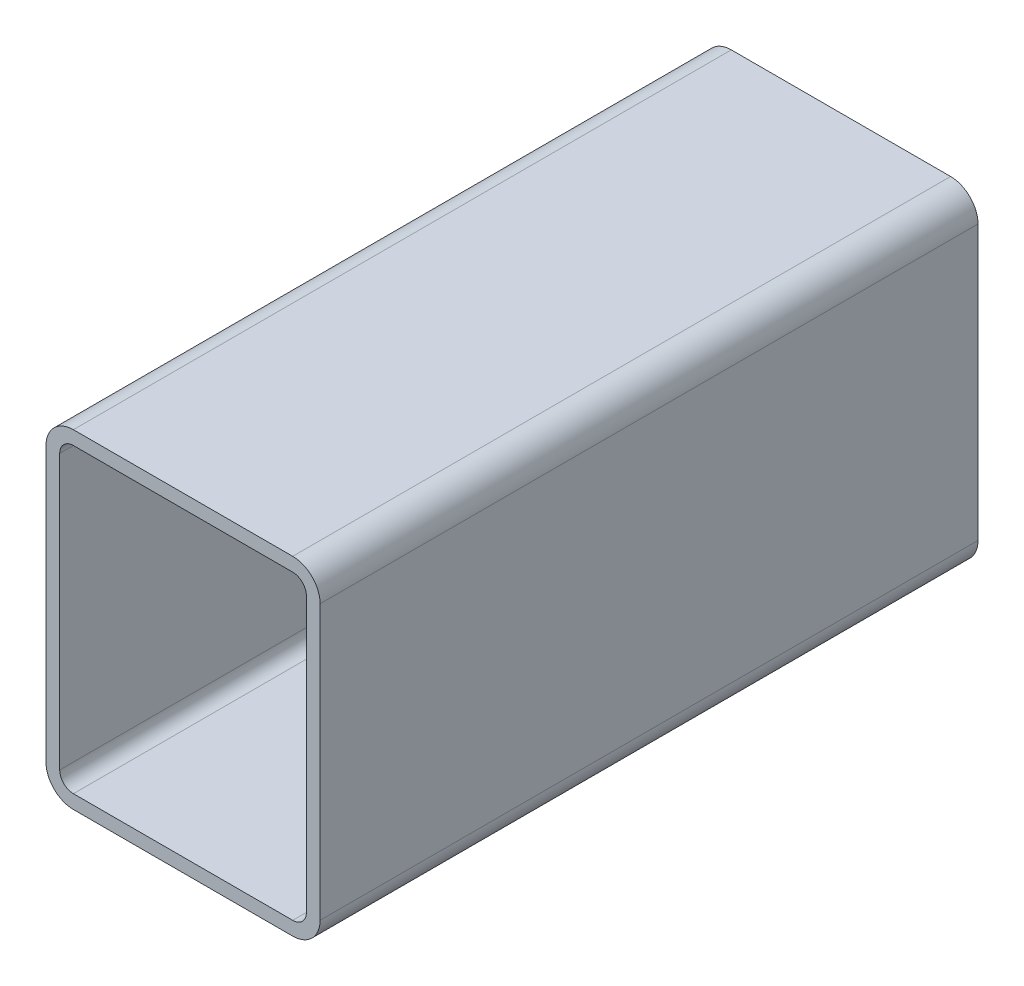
ISO-10303-21;
HEADER;
FILE_DESCRIPTION(('STEP AP214'),'2;1');
FILE_NAME('part.step','',(''),(''),'','','');
FILE_SCHEMA(('AUTOMOTIVE_DESIGN { 1 0 10303 214 1 1 1 1 }'));
ENDSEC;
DATA;
#1=APPLICATION_CONTEXT('core data for automotive mechanical design processes');
#2=APPLICATION_PROTOCOL_DEFINITION('international standard','automotive_design',2000,#1);
#3=PRODUCT_CONTEXT('',#1,'mechanical');
#4=PRODUCT('Part','Part','',(#3));
#5=PRODUCT_RELATED_PRODUCT_CATEGORY('part','',(#4));
#6=PRODUCT_DEFINITION_FORMATION('','',#4);
#7=PRODUCT_DEFINITION_CONTEXT('part definition',#1,'design');
#8=PRODUCT_DEFINITION('design','',#6,#7);
#9=PRODUCT_DEFINITION_SHAPE('','',#8);
#10=(LENGTH_UNIT() NAMED_UNIT(*) SI_UNIT(.MILLI.,.METRE.));
#11=(NAMED_UNIT(*) PLANE_ANGLE_UNIT() SI_UNIT($,.RADIAN.));
#12=(NAMED_UNIT(*) SI_UNIT($,.STERADIAN.) SOLID_ANGLE_UNIT());
#13=UNCERTAINTY_MEASURE_WITH_UNIT(LENGTH_MEASURE(1.E-05),#10,'distance_accuracy_value','');
#14=(GEOMETRIC_REPRESENTATION_CONTEXT(3) GLOBAL_UNCERTAINTY_ASSIGNED_CONTEXT((#13)) GLOBAL_UNIT_ASSIGNED_CONTEXT((#10,
#11,#12)) REPRESENTATION_CONTEXT('',''));
#15=CARTESIAN_POINT('',(0.,0.,0.));
#16=DIRECTION('',(0.,0.,1.));
#17=DIRECTION('',(1.,0.,0.));
#18=AXIS2_PLACEMENT_3D('',#15,#16,#17);
#19=CARTESIAN_POINT('',(13.5612396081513,141.711948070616,304.8));
#20=DIRECTION('',(0.,0.,1.));
#21=DIRECTION('',(1.,0.,0.));
#22=AXIS2_PLACEMENT_3D('',#19,#20,#21);
#23=PLANE('',#22);
#24=CARTESIAN_POINT('',(13.5612396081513,141.711948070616,304.8));
#25=DIRECTION('',(0.,0.,1.));
#26=DIRECTION('',(1.,0.,0.));
#27=AXIS2_PLACEMENT_3D('',#24,#25,#26);
#28=CIRCLE('',#27,12.7);
#29=CARTESIAN_POINT('',(13.5612396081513,154.411948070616,304.8));
#30=VERTEX_POINT('',#29);
#31=CARTESIAN_POINT('',(0.8612396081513,141.711948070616,304.8));
#32=VERTEX_POINT('',#31);
#33=EDGE_CURVE('E211',#30,#32,#28,.T.);
#34=ORIENTED_EDGE('',*,*,#33,.T.);
#35=DIRECTION('',(0.,-1.,0.));
#36=VECTOR('',#35,1.);
#37=CARTESIAN_POINT('',(0.8612396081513,14.7119480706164,304.8));
#38=LINE('',#37,#36);
#39=CARTESIAN_POINT('',(0.8612396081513,14.7119480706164,304.8));
#40=VERTEX_POINT('',#39);
#41=EDGE_CURVE('E214',#32,#40,#38,.T.);
#42=ORIENTED_EDGE('',*,*,#41,.T.);
#43=CARTESIAN_POINT('',(13.5612396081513,14.7119480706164,304.8));
#44=DIRECTION('',(0.,0.,1.));
#45=DIRECTION('',(1.,0.,0.));
#46=AXIS2_PLACEMENT_3D('',#43,#44,#45);
#47=CIRCLE('',#46,12.7);
#48=CARTESIAN_POINT('',(13.5612396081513,2.01194807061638,304.8));
#49=VERTEX_POINT('',#48);
#50=EDGE_CURVE('E217',#40,#49,#47,.T.);
#51=ORIENTED_EDGE('',*,*,#50,.T.);
#52=DIRECTION('',(1.,0.,0.));
#53=VECTOR('',#52,1.);
#54=CARTESIAN_POINT('',(115.161239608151,2.01194807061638,304.8));
#55=LINE('',#54,#53);
#56=CARTESIAN_POINT('',(115.161239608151,2.01194807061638,304.8));
#57=VERTEX_POINT('',#56);
#58=EDGE_CURVE('E219',#49,#57,#55,.T.);
#59=ORIENTED_EDGE('',*,*,#58,.T.);
#60=CARTESIAN_POINT('',(115.161239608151,14.7119480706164,304.8));
#61=DIRECTION('',(0.,0.,1.));
#62=DIRECTION('',(1.,0.,0.));
#63=AXIS2_PLACEMENT_3D('',#60,#61,#62);
#64=CIRCLE('',#63,12.7);
#65=CARTESIAN_POINT('',(127.861239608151,14.7119480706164,304.8));
#66=VERTEX_POINT('',#65);
#67=EDGE_CURVE('E221',#57,#66,#64,.T.);
#68=ORIENTED_EDGE('',*,*,#67,.T.);
#69=DIRECTION('',(0.,1.,0.));
#70=VECTOR('',#69,1.);
#71=CARTESIAN_POINT('',(127.861239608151,141.711948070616,304.8));
#72=LINE('',#71,#70);
#73=CARTESIAN_POINT('',(127.861239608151,141.711948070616,304.8));
#74=VERTEX_POINT('',#73);
#75=EDGE_CURVE('E223',#66,#74,#72,.T.);
#76=ORIENTED_EDGE('',*,*,#75,.T.);
#77=CARTESIAN_POINT('',(115.161239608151,141.711948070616,304.8));
#78=DIRECTION('',(0.,0.,1.));
#79=DIRECTION('',(1.,0.,0.));
#80=AXIS2_PLACEMENT_3D('',#77,#78,#79);
#81=CIRCLE('',#80,12.7);
#82=CARTESIAN_POINT('',(115.161239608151,154.411948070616,304.8));
#83=VERTEX_POINT('',#82);
#84=EDGE_CURVE('E225',#74,#83,#81,.T.);
#85=ORIENTED_EDGE('',*,*,#84,.T.);
#86=DIRECTION('',(-1.,0.,0.));
#87=VECTOR('',#86,1.);
#88=CARTESIAN_POINT('',(13.5612396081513,154.411948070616,304.8));
#89=LINE('',#88,#87);
#90=EDGE_CURVE('E227',#83,#30,#89,.T.);
#91=ORIENTED_EDGE('',*,*,#90,.T.);
#92=EDGE_LOOP('',(#34,#42,#51,#59,#68,#76,#85,#91));
#93=FACE_BOUND('',#92,.T.);
#94=DIRECTION('',(0.,-1.,0.));
#95=VECTOR('',#94,1.);
#96=CARTESIAN_POINT('',(7.2112396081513,14.7119480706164,304.8));
#97=LINE('',#96,#95);
#98=CARTESIAN_POINT('',(7.2112396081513,141.711948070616,304.8));
#99=VERTEX_POINT('',#98);
#100=CARTESIAN_POINT('',(7.2112396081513,14.7119480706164,304.8));
#101=VERTEX_POINT('',#100);
#102=EDGE_CURVE('E154',#99,#101,#97,.T.);
#103=ORIENTED_EDGE('',*,*,#102,.F.);
#104=CARTESIAN_POINT('',(13.5612396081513,141.711948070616,304.8));
#105=DIRECTION('',(0.,0.,1.));
#106=DIRECTION('',(1.,0.,0.));
#107=AXIS2_PLACEMENT_3D('',#104,#105,#106);
#108=CIRCLE('',#107,6.35);
#109=CARTESIAN_POINT('',(13.5612396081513,148.061948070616,304.8));
#110=VERTEX_POINT('',#109);
#111=EDGE_CURVE('E146',#110,#99,#108,.T.);
#112=ORIENTED_EDGE('',*,*,#111,.F.);
#113=DIRECTION('',(-1.,0.,0.));
#114=VECTOR('',#113,1.);
#115=CARTESIAN_POINT('',(13.5612396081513,148.061948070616,304.8));
#116=LINE('',#115,#114);
#117=CARTESIAN_POINT('',(115.161239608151,148.061948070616,304.8));
#118=VERTEX_POINT('',#117);
#119=EDGE_CURVE('E179',#118,#110,#116,.T.);
#120=ORIENTED_EDGE('',*,*,#119,.F.);
#121=CARTESIAN_POINT('',(115.161239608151,141.711948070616,304.8));
#122=DIRECTION('',(0.,0.,1.));
#123=DIRECTION('',(1.,0.,0.));
#124=AXIS2_PLACEMENT_3D('',#121,#122,#123);
#125=CIRCLE('',#124,6.35);
#126=CARTESIAN_POINT('',(121.511239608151,141.711948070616,304.8));
#127=VERTEX_POINT('',#126);
#128=EDGE_CURVE('E177',#127,#118,#125,.T.);
#129=ORIENTED_EDGE('',*,*,#128,.F.);
#130=DIRECTION('',(0.,1.,0.));
#131=VECTOR('',#130,1.);
#132=CARTESIAN_POINT('',(121.511239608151,141.711948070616,304.8));
#133=LINE('',#132,#131);
#134=CARTESIAN_POINT('',(121.511239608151,14.7119480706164,304.8));
#135=VERTEX_POINT('',#134);
#136=EDGE_CURVE('E175',#135,#127,#133,.T.);
#137=ORIENTED_EDGE('',*,*,#136,.F.);
#138=CARTESIAN_POINT('',(115.161239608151,14.7119480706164,304.8));
#139=DIRECTION('',(0.,0.,1.));
#140=DIRECTION('',(1.,0.,0.));
#141=AXIS2_PLACEMENT_3D('',#138,#139,#140);
#142=CIRCLE('',#141,6.35000000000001);
#143=CARTESIAN_POINT('',(115.161239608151,8.36194807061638,304.8));
#144=VERTEX_POINT('',#143);
#145=EDGE_CURVE('E173',#144,#135,#142,.T.);
#146=ORIENTED_EDGE('',*,*,#145,.F.);
#147=DIRECTION('',(1.,0.,0.));
#148=VECTOR('',#147,1.);
#149=CARTESIAN_POINT('',(115.161239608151,8.36194807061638,304.8));
#150=LINE('',#149,#148);
#151=CARTESIAN_POINT('',(13.5612396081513,8.36194807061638,304.8));
#152=VERTEX_POINT('',#151);
#153=EDGE_CURVE('E169',#152,#144,#150,.T.);
#154=ORIENTED_EDGE('',*,*,#153,.F.);
#155=CARTESIAN_POINT('',(13.5612396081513,14.7119480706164,304.8));
#156=DIRECTION('',(0.,0.,1.));
#157=DIRECTION('',(1.,0.,0.));
#158=AXIS2_PLACEMENT_3D('',#155,#156,#157);
#159=CIRCLE('',#158,6.35);
#160=EDGE_CURVE('E167',#101,#152,#159,.T.);
#161=ORIENTED_EDGE('',*,*,#160,.F.);
#162=EDGE_LOOP('',(#103,#112,#120,#129,#137,#146,#154,#161));
#163=FACE_BOUND('',#162,.T.);
#164=ADVANCED_FACE('F33',(#93,#163),#23,.T.);
#165=CARTESIAN_POINT('',(13.5612396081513,141.711948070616,0.));
#166=DIRECTION('',(0.,0.,1.));
#167=DIRECTION('',(1.,0.,0.));
#168=AXIS2_PLACEMENT_3D('',#165,#166,#167);
#169=PLANE('',#168);
#170=CARTESIAN_POINT('',(13.5612396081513,141.711948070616,0.));
#171=DIRECTION('',(0.,0.,1.));
#172=DIRECTION('',(1.,0.,0.));
#173=AXIS2_PLACEMENT_3D('',#170,#171,#172);
#174=CIRCLE('',#173,12.7);
#175=CARTESIAN_POINT('',(13.5612396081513,154.411948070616,0.));
#176=VERTEX_POINT('',#175);
#177=CARTESIAN_POINT('',(0.8612396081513,141.711948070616,0.));
#178=VERTEX_POINT('',#177);
#179=EDGE_CURVE('E162',#176,#178,#174,.T.);
#180=ORIENTED_EDGE('',*,*,#179,.F.);
#181=DIRECTION('',(-1.,0.,0.));
#182=VECTOR('',#181,1.);
#183=CARTESIAN_POINT('',(13.5612396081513,154.411948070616,0.));
#184=LINE('',#183,#182);
#185=CARTESIAN_POINT('',(115.161239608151,154.411948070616,0.));
#186=VERTEX_POINT('',#185);
#187=EDGE_CURVE('E215',#186,#176,#184,.T.);
#188=ORIENTED_EDGE('',*,*,#187,.F.);
#189=CARTESIAN_POINT('',(115.161239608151,141.711948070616,0.));
#190=DIRECTION('',(0.,0.,1.));
#191=DIRECTION('',(1.,0.,0.));
#192=AXIS2_PLACEMENT_3D('',#189,#190,#191);
#193=CIRCLE('',#192,12.7);
#194=CARTESIAN_POINT('',(127.861239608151,141.711948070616,0.));
#195=VERTEX_POINT('',#194);
#196=EDGE_CURVE('E242',#195,#186,#193,.T.);
#197=ORIENTED_EDGE('',*,*,#196,.F.);
#198=DIRECTION('',(0.,1.,0.));
#199=VECTOR('',#198,1.);
#200=CARTESIAN_POINT('',(127.861239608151,141.711948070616,0.));
#201=LINE('',#200,#199);
#202=CARTESIAN_POINT('',(127.861239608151,14.7119480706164,0.));
#203=VERTEX_POINT('',#202);
#204=EDGE_CURVE('E240',#203,#195,#201,.T.);
#205=ORIENTED_EDGE('',*,*,#204,.F.);
#206=CARTESIAN_POINT('',(115.161239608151,14.7119480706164,0.));
#207=DIRECTION('',(0.,0.,1.));
#208=DIRECTION('',(1.,0.,0.));
#209=AXIS2_PLACEMENT_3D('',#206,#207,#208);
#210=CIRCLE('',#209,12.7);
#211=CARTESIAN_POINT('',(115.161239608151,2.01194807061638,0.));
#212=VERTEX_POINT('',#211);
#213=EDGE_CURVE('E238',#212,#203,#210,.T.);
#214=ORIENTED_EDGE('',*,*,#213,.F.);
#215=DIRECTION('',(1.,0.,0.));
#216=VECTOR('',#215,1.);
#217=CARTESIAN_POINT('',(115.161239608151,2.01194807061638,0.));
#218=LINE('',#217,#216);
#219=CARTESIAN_POINT('',(13.5612396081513,2.01194807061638,0.));
#220=VERTEX_POINT('',#219);
#221=EDGE_CURVE('E236',#220,#212,#218,.T.);
#222=ORIENTED_EDGE('',*,*,#221,.F.);
#223=CARTESIAN_POINT('',(13.5612396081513,14.7119480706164,0.));
#224=DIRECTION('',(0.,0.,1.));
#225=DIRECTION('',(1.,0.,0.));
#226=AXIS2_PLACEMENT_3D('',#223,#224,#225);
#227=CIRCLE('',#226,12.7);
#228=CARTESIAN_POINT('',(0.8612396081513,14.7119480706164,0.));
#229=VERTEX_POINT('',#228);
#230=EDGE_CURVE('E234',#229,#220,#227,.T.);
#231=ORIENTED_EDGE('',*,*,#230,.F.);
#232=DIRECTION('',(0.,-1.,0.));
#233=VECTOR('',#232,1.);
#234=CARTESIAN_POINT('',(0.8612396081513,14.7119480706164,0.));
#235=LINE('',#234,#233);
#236=EDGE_CURVE('E232',#178,#229,#235,.T.);
#237=ORIENTED_EDGE('',*,*,#236,.F.);
#238=EDGE_LOOP('',(#180,#188,#197,#205,#214,#222,#231,#237));
#239=FACE_BOUND('',#238,.T.);
#240=CARTESIAN_POINT('',(13.5612396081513,141.711948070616,0.));
#241=DIRECTION('',(0.,0.,1.));
#242=DIRECTION('',(1.,0.,0.));
#243=AXIS2_PLACEMENT_3D('',#240,#241,#242);
#244=CIRCLE('',#243,6.35);
#245=CARTESIAN_POINT('',(13.5612396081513,148.061948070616,0.));
#246=VERTEX_POINT('',#245);
#247=CARTESIAN_POINT('',(7.2112396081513,141.711948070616,0.));
#248=VERTEX_POINT('',#247);
#249=EDGE_CURVE('E56',#246,#248,#244,.T.);
#250=ORIENTED_EDGE('',*,*,#249,.T.);
#251=DIRECTION('',(0.,-1.,0.));
#252=VECTOR('',#251,1.);
#253=CARTESIAN_POINT('',(7.2112396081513,14.7119480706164,0.));
#254=LINE('',#253,#252);
#255=CARTESIAN_POINT('',(7.2112396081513,14.7119480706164,0.));
#256=VERTEX_POINT('',#255);
#257=EDGE_CURVE('E161',#248,#256,#254,.T.);
#258=ORIENTED_EDGE('',*,*,#257,.T.);
#259=CARTESIAN_POINT('',(13.5612396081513,14.7119480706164,0.));
#260=DIRECTION('',(0.,0.,1.));
#261=DIRECTION('',(1.,0.,0.));
#262=AXIS2_PLACEMENT_3D('',#259,#260,#261);
#263=CIRCLE('',#262,6.35);
#264=CARTESIAN_POINT('',(13.5612396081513,8.36194807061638,0.));
#265=VERTEX_POINT('',#264);
#266=EDGE_CURVE('E183',#256,#265,#263,.T.);
#267=ORIENTED_EDGE('',*,*,#266,.T.);
#268=DIRECTION('',(1.,0.,0.));
#269=VECTOR('',#268,1.);
#270=CARTESIAN_POINT('',(115.161239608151,8.36194807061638,0.));
#271=LINE('',#270,#269);
#272=CARTESIAN_POINT('',(115.161239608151,8.36194807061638,0.));
#273=VERTEX_POINT('',#272);
#274=EDGE_CURVE('E186',#265,#273,#271,.T.);
#275=ORIENTED_EDGE('',*,*,#274,.T.);
#276=CARTESIAN_POINT('',(115.161239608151,14.7119480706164,0.));
#277=DIRECTION('',(0.,0.,1.));
#278=DIRECTION('',(1.,0.,0.));
#279=AXIS2_PLACEMENT_3D('',#276,#277,#278);
#280=CIRCLE('',#279,6.35000000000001);
#281=CARTESIAN_POINT('',(121.511239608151,14.7119480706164,0.));
#282=VERTEX_POINT('',#281);
#283=EDGE_CURVE('E189',#273,#282,#280,.T.);
#284=ORIENTED_EDGE('',*,*,#283,.T.);
#285=DIRECTION('',(0.,1.,0.));
#286=VECTOR('',#285,1.);
#287=CARTESIAN_POINT('',(121.511239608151,141.711948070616,0.));
#288=LINE('',#287,#286);
#289=CARTESIAN_POINT('',(121.511239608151,141.711948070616,0.));
#290=VERTEX_POINT('',#289);
#291=EDGE_CURVE('E192',#282,#290,#288,.T.);
#292=ORIENTED_EDGE('',*,*,#291,.T.);
#293=CARTESIAN_POINT('',(115.161239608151,141.711948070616,0.));
#294=DIRECTION('',(0.,0.,1.));
#295=DIRECTION('',(1.,0.,0.));
#296=AXIS2_PLACEMENT_3D('',#293,#294,#295);
#297=CIRCLE('',#296,6.35);
#298=CARTESIAN_POINT('',(115.161239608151,148.061948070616,0.));
#299=VERTEX_POINT('',#298);
#300=EDGE_CURVE('E195',#290,#299,#297,.T.);
#301=ORIENTED_EDGE('',*,*,#300,.T.);
#302=DIRECTION('',(-1.,0.,0.));
#303=VECTOR('',#302,1.);
#304=CARTESIAN_POINT('',(13.5612396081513,148.061948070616,0.));
#305=LINE('',#304,#303);
#306=EDGE_CURVE('E155',#299,#246,#305,.T.);
#307=ORIENTED_EDGE('',*,*,#306,.T.);
#308=EDGE_LOOP('',(#250,#258,#267,#275,#284,#292,#301,#307));
#309=FACE_BOUND('',#308,.T.);
#310=ADVANCED_FACE('F272',(#239,#309),#169,.F.);
#311=CARTESIAN_POINT('',(13.5612396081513,141.711948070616,304.8));
#312=DIRECTION('',(0.,0.,-1.));
#313=DIRECTION('',(-1.,0.,0.));
#314=AXIS2_PLACEMENT_3D('',#311,#312,#313);
#315=CYLINDRICAL_SURFACE('',#314,12.7);
#316=ORIENTED_EDGE('',*,*,#179,.T.);
#317=DIRECTION('',(0.,0.,-1.));
#318=VECTOR('',#317,1.);
#319=CARTESIAN_POINT('',(0.8612396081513,141.711948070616,304.8));
#320=LINE('',#319,#318);
#321=EDGE_CURVE('E11',#32,#178,#320,.T.);
#322=ORIENTED_EDGE('',*,*,#321,.F.);
#323=ORIENTED_EDGE('',*,*,#33,.F.);
#324=DIRECTION('',(0.,0.,-1.));
#325=VECTOR('',#324,1.);
#326=CARTESIAN_POINT('',(13.5612396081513,154.411948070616,304.8));
#327=LINE('',#326,#325);
#328=EDGE_CURVE('E229',#30,#176,#327,.T.);
#329=ORIENTED_EDGE('',*,*,#328,.T.);
#330=EDGE_LOOP('',(#316,#322,#323,#329));
#331=FACE_BOUND('',#330,.T.);
#332=ADVANCED_FACE('F35',(#331),#315,.T.);
#333=CARTESIAN_POINT('',(0.8612396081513,14.7119480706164,304.8));
#334=DIRECTION('',(1.,0.,0.));
#335=DIRECTION('',(0.,0.,-1.));
#336=AXIS2_PLACEMENT_3D('',#333,#334,#335);
#337=PLANE('',#336);
#338=ORIENTED_EDGE('',*,*,#236,.T.);
#339=DIRECTION('',(0.,0.,-1.));
#340=VECTOR('',#339,1.);
#341=CARTESIAN_POINT('',(0.8612396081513,14.7119480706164,304.8));
#342=LINE('',#341,#340);
#343=EDGE_CURVE('E41',#40,#229,#342,.T.);
#344=ORIENTED_EDGE('',*,*,#343,.F.);
#345=ORIENTED_EDGE('',*,*,#41,.F.);
#346=ORIENTED_EDGE('',*,*,#321,.T.);
#347=EDGE_LOOP('',(#338,#344,#345,#346));
#348=FACE_BOUND('',#347,.T.);
#349=ADVANCED_FACE('F289',(#348),#337,.F.);
#350=CARTESIAN_POINT('',(13.5612396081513,14.7119480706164,304.8));
#351=DIRECTION('',(0.,0.,-1.));
#352=DIRECTION('',(-1.,0.,0.));
#353=AXIS2_PLACEMENT_3D('',#350,#351,#352);
#354=CYLINDRICAL_SURFACE('',#353,12.7);
#355=ORIENTED_EDGE('',*,*,#230,.T.);
#356=DIRECTION('',(0.,0.,-1.));
#357=VECTOR('',#356,1.);
#358=CARTESIAN_POINT('',(13.5612396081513,2.01194807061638,304.8));
#359=LINE('',#358,#357);
#360=EDGE_CURVE('E259',#49,#220,#359,.T.);
#361=ORIENTED_EDGE('',*,*,#360,.F.);
#362=ORIENTED_EDGE('',*,*,#50,.F.);
#363=ORIENTED_EDGE('',*,*,#343,.T.);
#364=EDGE_LOOP('',(#355,#361,#362,#363));
#365=FACE_BOUND('',#364,.T.);
#366=ADVANCED_FACE('F266',(#365),#354,.T.);
#367=CARTESIAN_POINT('',(115.161239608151,2.01194807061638,304.8));
#368=DIRECTION('',(0.,1.,0.));
#369=DIRECTION('',(0.,0.,1.));
#370=AXIS2_PLACEMENT_3D('',#367,#368,#369);
#371=PLANE('',#370);
#372=ORIENTED_EDGE('',*,*,#221,.T.);
#373=DIRECTION('',(0.,0.,-1.));
#374=VECTOR('',#373,1.);
#375=CARTESIAN_POINT('',(115.161239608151,2.01194807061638,304.8));
#376=LINE('',#375,#374);
#377=EDGE_CURVE('E256',#57,#212,#376,.T.);
#378=ORIENTED_EDGE('',*,*,#377,.F.);
#379=ORIENTED_EDGE('',*,*,#58,.F.);
#380=ORIENTED_EDGE('',*,*,#360,.T.);
#381=EDGE_LOOP('',(#372,#378,#379,#380));
#382=FACE_BOUND('',#381,.T.);
#383=ADVANCED_FACE('F278',(#382),#371,.F.);
#384=CARTESIAN_POINT('',(115.161239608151,14.7119480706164,304.8));
#385=DIRECTION('',(0.,0.,-1.));
#386=DIRECTION('',(-1.,0.,0.));
#387=AXIS2_PLACEMENT_3D('',#384,#385,#386);
#388=CYLINDRICAL_SURFACE('',#387,12.7);
#389=ORIENTED_EDGE('',*,*,#213,.T.);
#390=DIRECTION('',(0.,0.,-1.));
#391=VECTOR('',#390,1.);
#392=CARTESIAN_POINT('',(127.861239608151,14.7119480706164,304.8));
#393=LINE('',#392,#391);
#394=EDGE_CURVE('E253',#66,#203,#393,.T.);
#395=ORIENTED_EDGE('',*,*,#394,.F.);
#396=ORIENTED_EDGE('',*,*,#67,.F.);
#397=ORIENTED_EDGE('',*,*,#377,.T.);
#398=EDGE_LOOP('',(#389,#395,#396,#397));
#399=FACE_BOUND('',#398,.T.);
#400=ADVANCED_FACE('F282',(#399),#388,.T.);
#401=CARTESIAN_POINT('',(127.861239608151,141.711948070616,304.8));
#402=DIRECTION('',(-1.,0.,0.));
#403=DIRECTION('',(0.,0.,1.));
#404=AXIS2_PLACEMENT_3D('',#401,#402,#403);
#405=PLANE('',#404);
#406=ORIENTED_EDGE('',*,*,#204,.T.);
#407=DIRECTION('',(0.,0.,-1.));
#408=VECTOR('',#407,1.);
#409=CARTESIAN_POINT('',(127.861239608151,141.711948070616,304.8));
#410=LINE('',#409,#408);
#411=EDGE_CURVE('E250',#74,#195,#410,.T.);
#412=ORIENTED_EDGE('',*,*,#411,.F.);
#413=ORIENTED_EDGE('',*,*,#75,.F.);
#414=ORIENTED_EDGE('',*,*,#394,.T.);
#415=EDGE_LOOP('',(#406,#412,#413,#414));
#416=FACE_BOUND('',#415,.T.);
#417=ADVANCED_FACE('F302',(#416),#405,.F.);
#418=CARTESIAN_POINT('',(115.161239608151,141.711948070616,304.8));
#419=DIRECTION('',(0.,0.,-1.));
#420=DIRECTION('',(-1.,0.,0.));
#421=AXIS2_PLACEMENT_3D('',#418,#419,#420);
#422=CYLINDRICAL_SURFACE('',#421,12.7);
#423=ORIENTED_EDGE('',*,*,#196,.T.);
#424=DIRECTION('',(0.,0.,-1.));
#425=VECTOR('',#424,1.);
#426=CARTESIAN_POINT('',(115.161239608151,154.411948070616,304.8));
#427=LINE('',#426,#425);
#428=EDGE_CURVE('E247',#83,#186,#427,.T.);
#429=ORIENTED_EDGE('',*,*,#428,.F.);
#430=ORIENTED_EDGE('',*,*,#84,.F.);
#431=ORIENTED_EDGE('',*,*,#411,.T.);
#432=EDGE_LOOP('',(#423,#429,#430,#431));
#433=FACE_BOUND('',#432,.T.);
#434=ADVANCED_FACE('F300',(#433),#422,.T.);
#435=CARTESIAN_POINT('',(13.5612396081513,154.411948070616,304.8));
#436=DIRECTION('',(0.,-1.,0.));
#437=DIRECTION('',(0.,0.,-1.));
#438=AXIS2_PLACEMENT_3D('',#435,#436,#437);
#439=PLANE('',#438);
#440=ORIENTED_EDGE('',*,*,#187,.T.);
#441=ORIENTED_EDGE('',*,*,#328,.F.);
#442=ORIENTED_EDGE('',*,*,#90,.F.);
#443=ORIENTED_EDGE('',*,*,#428,.T.);
#444=EDGE_LOOP('',(#440,#441,#442,#443));
#445=FACE_BOUND('',#444,.T.);
#446=ADVANCED_FACE('F295',(#445),#439,.F.);
#447=CARTESIAN_POINT('',(13.5612396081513,141.711948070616,304.8));
#448=DIRECTION('',(0.,0.,-1.));
#449=DIRECTION('',(-1.,0.,0.));
#450=AXIS2_PLACEMENT_3D('',#447,#448,#449);
#451=CYLINDRICAL_SURFACE('',#450,6.35);
#452=ORIENTED_EDGE('',*,*,#249,.F.);
#453=DIRECTION('',(0.,0.,-1.));
#454=VECTOR('',#453,1.);
#455=CARTESIAN_POINT('',(13.5612396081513,148.061948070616,304.8));
#456=LINE('',#455,#454);
#457=EDGE_CURVE('E150',#110,#246,#456,.T.);
#458=ORIENTED_EDGE('',*,*,#457,.F.);
#459=ORIENTED_EDGE('',*,*,#111,.T.);
#460=DIRECTION('',(0.,0.,-1.));
#461=VECTOR('',#460,1.);
#462=CARTESIAN_POINT('',(7.2112396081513,141.711948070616,304.8));
#463=LINE('',#462,#461);
#464=EDGE_CURVE('E149',#99,#248,#463,.T.);
#465=ORIENTED_EDGE('',*,*,#464,.T.);
#466=EDGE_LOOP('',(#452,#458,#459,#465));
#467=FACE_BOUND('',#466,.T.);
#468=ADVANCED_FACE('F148',(#467),#451,.F.);
#469=CARTESIAN_POINT('',(7.2112396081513,14.7119480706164,304.8));
#470=DIRECTION('',(1.,0.,0.));
#471=DIRECTION('',(0.,0.,-1.));
#472=AXIS2_PLACEMENT_3D('',#469,#470,#471);
#473=PLANE('',#472);
#474=ORIENTED_EDGE('',*,*,#257,.F.);
#475=ORIENTED_EDGE('',*,*,#464,.F.);
#476=ORIENTED_EDGE('',*,*,#102,.T.);
#477=DIRECTION('',(0.,0.,-1.));
#478=VECTOR('',#477,1.);
#479=CARTESIAN_POINT('',(7.2112396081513,14.7119480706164,304.8));
#480=LINE('',#479,#478);
#481=EDGE_CURVE('E163',#101,#256,#480,.T.);
#482=ORIENTED_EDGE('',*,*,#481,.T.);
#483=EDGE_LOOP('',(#474,#475,#476,#482));
#484=FACE_BOUND('',#483,.T.);
#485=ADVANCED_FACE('F158',(#484),#473,.T.);
#486=CARTESIAN_POINT('',(13.5612396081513,14.7119480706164,304.8));
#487=DIRECTION('',(0.,0.,-1.));
#488=DIRECTION('',(-1.,0.,0.));
#489=AXIS2_PLACEMENT_3D('',#486,#487,#488);
#490=CYLINDRICAL_SURFACE('',#489,6.35);
#491=ORIENTED_EDGE('',*,*,#266,.F.);
#492=ORIENTED_EDGE('',*,*,#481,.F.);
#493=ORIENTED_EDGE('',*,*,#160,.T.);
#494=DIRECTION('',(0.,0.,-1.));
#495=VECTOR('',#494,1.);
#496=CARTESIAN_POINT('',(13.5612396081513,8.36194807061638,304.8));
#497=LINE('',#496,#495);
#498=EDGE_CURVE('E208',#152,#265,#497,.T.);
#499=ORIENTED_EDGE('',*,*,#498,.T.);
#500=EDGE_LOOP('',(#491,#492,#493,#499));
#501=FACE_BOUND('',#500,.T.);
#502=ADVANCED_FACE('F327',(#501),#490,.F.);
#503=CARTESIAN_POINT('',(115.161239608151,8.36194807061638,304.8));
#504=DIRECTION('',(0.,1.,0.));
#505=DIRECTION('',(0.,0.,1.));
#506=AXIS2_PLACEMENT_3D('',#503,#504,#505);
#507=PLANE('',#506);
#508=ORIENTED_EDGE('',*,*,#274,.F.);
#509=ORIENTED_EDGE('',*,*,#498,.F.);
#510=ORIENTED_EDGE('',*,*,#153,.T.);
#511=DIRECTION('',(0.,0.,-1.));
#512=VECTOR('',#511,1.);
#513=CARTESIAN_POINT('',(115.161239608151,8.36194807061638,304.8));
#514=LINE('',#513,#512);
#515=EDGE_CURVE('E206',#144,#273,#514,.T.);
#516=ORIENTED_EDGE('',*,*,#515,.T.);
#517=EDGE_LOOP('',(#508,#509,#510,#516));
#518=FACE_BOUND('',#517,.T.);
#519=ADVANCED_FACE('F331',(#518),#507,.T.);
#520=CARTESIAN_POINT('',(115.161239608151,14.7119480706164,304.8));
#521=DIRECTION('',(0.,0.,-1.));
#522=DIRECTION('',(-1.,0.,0.));
#523=AXIS2_PLACEMENT_3D('',#520,#521,#522);
#524=CYLINDRICAL_SURFACE('',#523,6.35000000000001);
#525=ORIENTED_EDGE('',*,*,#283,.F.);
#526=ORIENTED_EDGE('',*,*,#515,.F.);
#527=ORIENTED_EDGE('',*,*,#145,.T.);
#528=DIRECTION('',(0.,0.,-1.));
#529=VECTOR('',#528,1.);
#530=CARTESIAN_POINT('',(121.511239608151,14.7119480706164,304.8));
#531=LINE('',#530,#529);
#532=EDGE_CURVE('E204',#135,#282,#531,.T.);
#533=ORIENTED_EDGE('',*,*,#532,.T.);
#534=EDGE_LOOP('',(#525,#526,#527,#533));
#535=FACE_BOUND('',#534,.T.);
#536=ADVANCED_FACE('F337',(#535),#524,.F.);
#537=CARTESIAN_POINT('',(121.511239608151,141.711948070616,304.8));
#538=DIRECTION('',(-1.,0.,0.));
#539=DIRECTION('',(0.,0.,1.));
#540=AXIS2_PLACEMENT_3D('',#537,#538,#539);
#541=PLANE('',#540);
#542=ORIENTED_EDGE('',*,*,#291,.F.);
#543=ORIENTED_EDGE('',*,*,#532,.F.);
#544=ORIENTED_EDGE('',*,*,#136,.T.);
#545=DIRECTION('',(0.,0.,-1.));
#546=VECTOR('',#545,1.);
#547=CARTESIAN_POINT('',(121.511239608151,141.711948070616,304.8));
#548=LINE('',#547,#546);
#549=EDGE_CURVE('E202',#127,#290,#548,.T.);
#550=ORIENTED_EDGE('',*,*,#549,.T.);
#551=EDGE_LOOP('',(#542,#543,#544,#550));
#552=FACE_BOUND('',#551,.T.);
#553=ADVANCED_FACE('F341',(#552),#541,.T.);
#554=CARTESIAN_POINT('',(115.161239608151,141.711948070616,304.8));
#555=DIRECTION('',(0.,0.,-1.));
#556=DIRECTION('',(-1.,0.,0.));
#557=AXIS2_PLACEMENT_3D('',#554,#555,#556);
#558=CYLINDRICAL_SURFACE('',#557,6.35);
#559=ORIENTED_EDGE('',*,*,#300,.F.);
#560=ORIENTED_EDGE('',*,*,#549,.F.);
#561=ORIENTED_EDGE('',*,*,#128,.T.);
#562=DIRECTION('',(0.,0.,-1.));
#563=VECTOR('',#562,1.);
#564=CARTESIAN_POINT('',(115.161239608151,148.061948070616,304.8));
#565=LINE('',#564,#563);
#566=EDGE_CURVE('E48',#118,#299,#565,.T.);
#567=ORIENTED_EDGE('',*,*,#566,.T.);
#568=EDGE_LOOP('',(#559,#560,#561,#567));
#569=FACE_BOUND('',#568,.T.);
#570=ADVANCED_FACE('F345',(#569),#558,.F.);
#571=CARTESIAN_POINT('',(13.5612396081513,148.061948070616,304.8));
#572=DIRECTION('',(0.,-1.,0.));
#573=DIRECTION('',(0.,0.,-1.));
#574=AXIS2_PLACEMENT_3D('',#571,#572,#573);
#575=PLANE('',#574);
#576=ORIENTED_EDGE('',*,*,#306,.F.);
#577=ORIENTED_EDGE('',*,*,#566,.F.);
#578=ORIENTED_EDGE('',*,*,#119,.T.);
#579=ORIENTED_EDGE('',*,*,#457,.T.);
#580=EDGE_LOOP('',(#576,#577,#578,#579));
#581=FACE_BOUND('',#580,.T.);
#582=ADVANCED_FACE('F349',(#581),#575,.T.);
#583=CLOSED_SHELL('',(#164,#310,#332,#349,#366,#383,#400,#417,#434,#446,#468,#485,#502,#519,
#536,#553,#570,#582));
#584=MANIFOLD_SOLID_BREP('B2',#583);
#585=ADVANCED_BREP_SHAPE_REPRESENTATION('',(#18,#584),#14);
#586=SHAPE_DEFINITION_REPRESENTATION(#9,#585);
ENDSEC;
END-ISO-10303-21;
